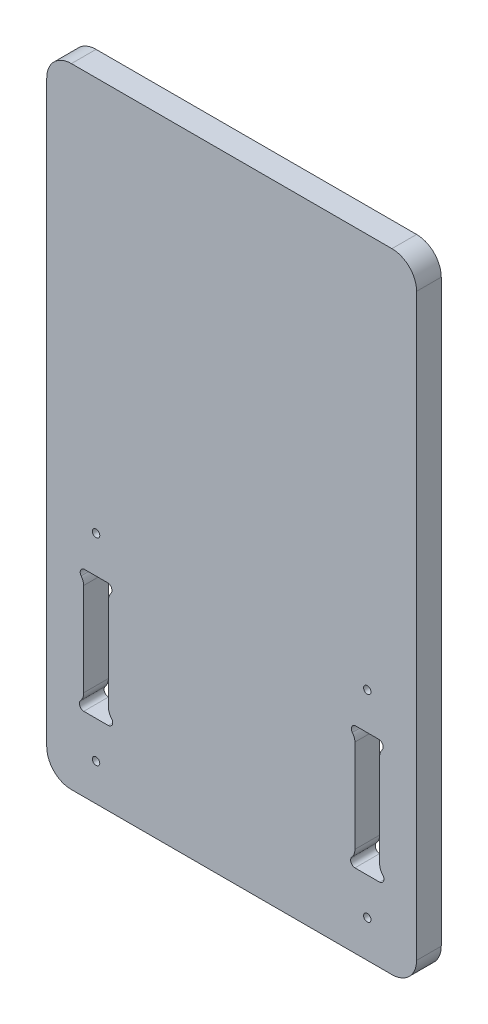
ISO-10303-21;
HEADER;
FILE_DESCRIPTION(('STEP AP214'),'2;1');
FILE_NAME('part.step','',(''),(''),'','','');
FILE_SCHEMA(('AUTOMOTIVE_DESIGN { 1 0 10303 214 1 1 1 1 }'));
ENDSEC;
DATA;
#1=APPLICATION_CONTEXT('core data for automotive mechanical design processes');
#2=APPLICATION_PROTOCOL_DEFINITION('international standard','automotive_design',2000,#1);
#3=PRODUCT_CONTEXT('',#1,'mechanical');
#4=PRODUCT('Part','Part','',(#3));
#5=PRODUCT_RELATED_PRODUCT_CATEGORY('part','',(#4));
#6=PRODUCT_DEFINITION_FORMATION('','',#4);
#7=PRODUCT_DEFINITION_CONTEXT('part definition',#1,'design');
#8=PRODUCT_DEFINITION('design','',#6,#7);
#9=PRODUCT_DEFINITION_SHAPE('','',#8);
#10=(LENGTH_UNIT() NAMED_UNIT(*) SI_UNIT(.MILLI.,.METRE.));
#11=(NAMED_UNIT(*) PLANE_ANGLE_UNIT() SI_UNIT($,.RADIAN.));
#12=(NAMED_UNIT(*) SI_UNIT($,.STERADIAN.) SOLID_ANGLE_UNIT());
#13=UNCERTAINTY_MEASURE_WITH_UNIT(LENGTH_MEASURE(1.E-05),#10,'distance_accuracy_value','');
#14=(GEOMETRIC_REPRESENTATION_CONTEXT(3) GLOBAL_UNCERTAINTY_ASSIGNED_CONTEXT((#13)) GLOBAL_UNIT_ASSIGNED_CONTEXT((#10,
#11,#12)) REPRESENTATION_CONTEXT('',''));
#15=CARTESIAN_POINT('',(0.,0.,0.));
#16=DIRECTION('',(0.,0.,1.));
#17=DIRECTION('',(1.,0.,0.));
#18=AXIS2_PLACEMENT_3D('',#15,#16,#17);
#19=CARTESIAN_POINT('',(-65.0000084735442,-45.0130180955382,10.));
#20=DIRECTION('',(0.,0.,1.));
#21=DIRECTION('',(1.,0.,0.));
#22=AXIS2_PLACEMENT_3D('',#19,#20,#21);
#23=PLANE('',#22);
#24=CARTESIAN_POINT('',(55.,-40.,10.));
#25=DIRECTION('',(0.,0.,1.));
#26=DIRECTION('',(-1.,0.,0.));
#27=AXIS2_PLACEMENT_3D('',#24,#25,#26);
#28=CIRCLE('',#27,1.5);
#29=CARTESIAN_POINT('',(53.5,-40.,10.));
#30=VERTEX_POINT('',#29);
#31=EDGE_CURVE('E588',#30,#30,#28,.T.);
#32=ORIENTED_EDGE('',*,*,#31,.F.);
#33=EDGE_LOOP('',(#32));
#34=FACE_BOUND('',#33,.T.);
#35=CARTESIAN_POINT('',(50.1277697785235,-23.1165738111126,10.));
#36=DIRECTION('',(0.,0.,1.));
#37=DIRECTION('',(1.,0.,0.));
#38=AXIS2_PLACEMENT_3D('',#35,#36,#37);
#39=CIRCLE('',#38,1.88775510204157);
#40=CARTESIAN_POINT('',(48.6220765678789,-21.9779310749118,10.));
#41=VERTEX_POINT('',#40);
#42=CARTESIAN_POINT('',(50.0000000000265,-25.,10.));
#43=VERTEX_POINT('',#42);
#44=EDGE_CURVE('E260',#41,#43,#39,.T.);
#45=ORIENTED_EDGE('',*,*,#44,.F.);
#46=CARTESIAN_POINT('',(44.8979591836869,-18.4905581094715,10.));
#47=DIRECTION('',(0.,0.,-1.));
#48=DIRECTION('',(1.,0.,0.));
#49=AXIS2_PLACEMENT_3D('',#46,#47,#48);
#50=CIRCLE('',#49,5.10204081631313);
#51=CARTESIAN_POINT('',(50.,-18.4905581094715,10.));
#52=VERTEX_POINT('',#51);
#53=EDGE_CURVE('E252',#52,#41,#50,.T.);
#54=ORIENTED_EDGE('',*,*,#53,.F.);
#55=DIRECTION('',(0.,-1.,0.));
#56=VECTOR('',#55,1.);
#57=CARTESIAN_POINT('',(50.,-18.4905581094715,10.));
#58=LINE('',#57,#56);
#59=CARTESIAN_POINT('',(50.,19.1989379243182,10.));
#60=VERTEX_POINT('',#59);
#61=EDGE_CURVE('E295',#60,#52,#58,.T.);
#62=ORIENTED_EDGE('',*,*,#61,.F.);
#63=CARTESIAN_POINT('',(44.9063812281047,18.9059049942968,10.));
#64=DIRECTION('',(0.,0.,-1.));
#65=DIRECTION('',(1.,0.,0.));
#66=AXIS2_PLACEMENT_3D('',#63,#64,#65);
#67=CIRCLE('',#66,5.10204081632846);
#68=CARTESIAN_POINT('',(48.9512370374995,22.0155612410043,10.));
#69=VERTEX_POINT('',#68);
#70=EDGE_CURVE('E293',#69,#60,#67,.T.);
#71=ORIENTED_EDGE('',*,*,#70,.F.);
#72=CARTESIAN_POINT('',(50.4478336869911,23.166134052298,10.));
#73=DIRECTION('',(0.,0.,1.));
#74=DIRECTION('',(1.,0.,0.));
#75=AXIS2_PLACEMENT_3D('',#72,#73,#74);
#76=CIRCLE('',#75,1.88775510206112);
#77=CARTESIAN_POINT('',(49.9999999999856,25.,10.));
#78=VERTEX_POINT('',#77);
#79=EDGE_CURVE('E291',#78,#69,#76,.T.);
#80=ORIENTED_EDGE('',*,*,#79,.F.);
#81=DIRECTION('',(-1.,0.,0.));
#82=VECTOR('',#81,1.);
#83=CARTESIAN_POINT('',(60.0000000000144,25.,10.));
#84=LINE('',#83,#82);
#85=CARTESIAN_POINT('',(60.0000000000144,25.,10.));
#86=VERTEX_POINT('',#85);
#87=EDGE_CURVE('E289',#86,#78,#84,.T.);
#88=ORIENTED_EDGE('',*,*,#87,.F.);
#89=CARTESIAN_POINT('',(59.5521663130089,23.166134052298,10.));
#90=DIRECTION('',(0.,0.,1.));
#91=DIRECTION('',(-1.,0.,0.));
#92=AXIS2_PLACEMENT_3D('',#89,#90,#91);
#93=CIRCLE('',#92,1.88775510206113);
#94=CARTESIAN_POINT('',(61.0487629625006,22.0155612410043,10.));
#95=VERTEX_POINT('',#94);
#96=EDGE_CURVE('E287',#95,#86,#93,.T.);
#97=ORIENTED_EDGE('',*,*,#96,.F.);
#98=CARTESIAN_POINT('',(65.0936187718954,18.9059049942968,10.));
#99=DIRECTION('',(0.,0.,-1.));
#100=DIRECTION('',(-1.,0.,0.));
#101=AXIS2_PLACEMENT_3D('',#98,#99,#100);
#102=CIRCLE('',#101,5.10204081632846);
#103=CARTESIAN_POINT('',(60.,19.1989379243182,10.));
#104=VERTEX_POINT('',#103);
#105=EDGE_CURVE('E285',#104,#95,#102,.T.);
#106=ORIENTED_EDGE('',*,*,#105,.F.);
#107=DIRECTION('',(0.,1.,0.));
#108=VECTOR('',#107,1.);
#109=CARTESIAN_POINT('',(60.,-18.4905581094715,10.));
#110=LINE('',#109,#108);
#111=CARTESIAN_POINT('',(60.,-18.4905581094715,10.));
#112=VERTEX_POINT('',#111);
#113=EDGE_CURVE('E283',#112,#104,#110,.T.);
#114=ORIENTED_EDGE('',*,*,#113,.F.);
#115=CARTESIAN_POINT('',(65.1020408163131,-18.4905581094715,10.));
#116=DIRECTION('',(0.,0.,-1.));
#117=DIRECTION('',(-1.,0.,0.));
#118=AXIS2_PLACEMENT_3D('',#115,#116,#117);
#119=CIRCLE('',#118,5.10204081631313);
#120=CARTESIAN_POINT('',(61.3779234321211,-21.9779310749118,10.));
#121=VERTEX_POINT('',#120);
#122=EDGE_CURVE('E281',#121,#112,#119,.T.);
#123=ORIENTED_EDGE('',*,*,#122,.F.);
#124=CARTESIAN_POINT('',(59.8722302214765,-23.1165738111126,10.));
#125=DIRECTION('',(0.,0.,1.));
#126=DIRECTION('',(-1.,0.,0.));
#127=AXIS2_PLACEMENT_3D('',#124,#125,#126);
#128=CIRCLE('',#127,1.88775510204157);
#129=CARTESIAN_POINT('',(59.9999999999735,-25.,10.));
#130=VERTEX_POINT('',#129);
#131=EDGE_CURVE('E276',#130,#121,#128,.T.);
#132=ORIENTED_EDGE('',*,*,#131,.F.);
#133=DIRECTION('',(1.,0.,0.));
#134=VECTOR('',#133,1.);
#135=CARTESIAN_POINT('',(50.0000000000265,-25.,10.));
#136=LINE('',#135,#134);
#137=EDGE_CURVE('E274',#43,#130,#136,.T.);
#138=ORIENTED_EDGE('',*,*,#137,.F.);
#139=EDGE_LOOP('',(#45,#54,#62,#71,#80,#88,#97,#106,#114,#123,#132,#138));
#140=FACE_BOUND('',#139,.T.);
#141=DIRECTION('',(1.,0.,0.));
#142=VECTOR('',#141,1.);
#143=CARTESIAN_POINT('',(-50.0000000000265,-25.,10.));
#144=LINE('',#143,#142);
#145=CARTESIAN_POINT('',(-59.9999999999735,-25.,10.));
#146=VERTEX_POINT('',#145);
#147=CARTESIAN_POINT('',(-50.0000000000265,-25.,10.));
#148=VERTEX_POINT('',#147);
#149=EDGE_CURVE('E350',#146,#148,#144,.T.);
#150=ORIENTED_EDGE('',*,*,#149,.F.);
#151=CARTESIAN_POINT('',(-59.8722302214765,-23.1165738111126,10.));
#152=DIRECTION('',(0.,0.,1.));
#153=DIRECTION('',(1.,0.,0.));
#154=AXIS2_PLACEMENT_3D('',#151,#152,#153);
#155=CIRCLE('',#154,1.88775510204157);
#156=CARTESIAN_POINT('',(-61.3779234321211,-21.9779310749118,10.));
#157=VERTEX_POINT('',#156);
#158=EDGE_CURVE('E348',#157,#146,#155,.T.);
#159=ORIENTED_EDGE('',*,*,#158,.F.);
#160=CARTESIAN_POINT('',(-65.1020408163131,-18.4905581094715,10.));
#161=DIRECTION('',(0.,0.,-1.));
#162=DIRECTION('',(1.,0.,0.));
#163=AXIS2_PLACEMENT_3D('',#160,#161,#162);
#164=CIRCLE('',#163,5.10204081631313);
#165=CARTESIAN_POINT('',(-60.,-18.4905581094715,10.));
#166=VERTEX_POINT('',#165);
#167=EDGE_CURVE('E372',#166,#157,#164,.T.);
#168=ORIENTED_EDGE('',*,*,#167,.F.);
#169=DIRECTION('',(0.,-1.,0.));
#170=VECTOR('',#169,1.);
#171=CARTESIAN_POINT('',(-60.,-18.4905581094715,10.));
#172=LINE('',#171,#170);
#173=CARTESIAN_POINT('',(-60.,19.1989379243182,10.));
#174=VERTEX_POINT('',#173);
#175=EDGE_CURVE('E369',#174,#166,#172,.T.);
#176=ORIENTED_EDGE('',*,*,#175,.F.);
#177=CARTESIAN_POINT('',(-65.0936187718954,18.9059049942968,10.));
#178=DIRECTION('',(0.,0.,-1.));
#179=DIRECTION('',(1.,0.,0.));
#180=AXIS2_PLACEMENT_3D('',#177,#178,#179);
#181=CIRCLE('',#180,5.10204081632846);
#182=CARTESIAN_POINT('',(-61.0487629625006,22.0155612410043,10.));
#183=VERTEX_POINT('',#182);
#184=EDGE_CURVE('E367',#183,#174,#181,.T.);
#185=ORIENTED_EDGE('',*,*,#184,.F.);
#186=CARTESIAN_POINT('',(-59.5521663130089,23.166134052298,10.));
#187=DIRECTION('',(0.,0.,1.));
#188=DIRECTION('',(1.,0.,0.));
#189=AXIS2_PLACEMENT_3D('',#186,#187,#188);
#190=CIRCLE('',#189,1.88775510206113);
#191=CARTESIAN_POINT('',(-60.0000000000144,25.,10.));
#192=VERTEX_POINT('',#191);
#193=EDGE_CURVE('E365',#192,#183,#190,.T.);
#194=ORIENTED_EDGE('',*,*,#193,.F.);
#195=DIRECTION('',(-1.,0.,0.));
#196=VECTOR('',#195,1.);
#197=CARTESIAN_POINT('',(-60.0000000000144,25.,10.));
#198=LINE('',#197,#196);
#199=CARTESIAN_POINT('',(-49.9999999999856,25.,10.));
#200=VERTEX_POINT('',#199);
#201=EDGE_CURVE('E363',#200,#192,#198,.T.);
#202=ORIENTED_EDGE('',*,*,#201,.F.);
#203=CARTESIAN_POINT('',(-50.4478336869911,23.166134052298,10.));
#204=DIRECTION('',(0.,0.,1.));
#205=DIRECTION('',(-1.,0.,0.));
#206=AXIS2_PLACEMENT_3D('',#203,#204,#205);
#207=CIRCLE('',#206,1.88775510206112);
#208=CARTESIAN_POINT('',(-48.9512370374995,22.0155612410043,10.));
#209=VERTEX_POINT('',#208);
#210=EDGE_CURVE('E361',#209,#200,#207,.T.);
#211=ORIENTED_EDGE('',*,*,#210,.F.);
#212=CARTESIAN_POINT('',(-44.9063812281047,18.9059049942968,10.));
#213=DIRECTION('',(0.,0.,-1.));
#214=DIRECTION('',(-1.,0.,0.));
#215=AXIS2_PLACEMENT_3D('',#212,#213,#214);
#216=CIRCLE('',#215,5.10204081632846);
#217=CARTESIAN_POINT('',(-50.,19.1989379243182,10.));
#218=VERTEX_POINT('',#217);
#219=EDGE_CURVE('E359',#218,#209,#216,.T.);
#220=ORIENTED_EDGE('',*,*,#219,.F.);
#221=DIRECTION('',(0.,1.,0.));
#222=VECTOR('',#221,1.);
#223=CARTESIAN_POINT('',(-50.,-18.4905581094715,10.));
#224=LINE('',#223,#222);
#225=CARTESIAN_POINT('',(-50.,-18.4905581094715,10.));
#226=VERTEX_POINT('',#225);
#227=EDGE_CURVE('E357',#226,#218,#224,.T.);
#228=ORIENTED_EDGE('',*,*,#227,.F.);
#229=CARTESIAN_POINT('',(-44.8979591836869,-18.4905581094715,10.));
#230=DIRECTION('',(0.,0.,-1.));
#231=DIRECTION('',(-1.,0.,0.));
#232=AXIS2_PLACEMENT_3D('',#229,#230,#231);
#233=CIRCLE('',#232,5.10204081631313);
#234=CARTESIAN_POINT('',(-48.6220765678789,-21.9779310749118,10.));
#235=VERTEX_POINT('',#234);
#236=EDGE_CURVE('E355',#235,#226,#233,.T.);
#237=ORIENTED_EDGE('',*,*,#236,.F.);
#238=CARTESIAN_POINT('',(-50.1277697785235,-23.1165738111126,10.));
#239=DIRECTION('',(0.,0.,1.));
#240=DIRECTION('',(-1.,0.,0.));
#241=AXIS2_PLACEMENT_3D('',#238,#239,#240);
#242=CIRCLE('',#241,1.88775510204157);
#243=EDGE_CURVE('E353',#148,#235,#242,.T.);
#244=ORIENTED_EDGE('',*,*,#243,.F.);
#245=EDGE_LOOP('',(#150,#159,#168,#176,#185,#194,#202,#211,#220,#228,#237,#244));
#246=FACE_BOUND('',#245,.T.);
#247=CARTESIAN_POINT('',(-55.,40.,10.));
#248=DIRECTION('',(0.,0.,1.));
#249=DIRECTION('',(-1.,0.,0.));
#250=AXIS2_PLACEMENT_3D('',#247,#248,#249);
#251=CIRCLE('',#250,1.5);
#252=CARTESIAN_POINT('',(-56.5,40.,10.));
#253=VERTEX_POINT('',#252);
#254=EDGE_CURVE('E435',#253,#253,#251,.T.);
#255=ORIENTED_EDGE('',*,*,#254,.F.);
#256=EDGE_LOOP('',(#255));
#257=FACE_BOUND('',#256,.T.);
#258=CARTESIAN_POINT('',(-65.0000084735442,-45.0130180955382,10.));
#259=DIRECTION('',(0.,0.,1.));
#260=DIRECTION('',(1.,0.,0.));
#261=AXIS2_PLACEMENT_3D('',#258,#259,#260);
#262=CIRCLE('',#261,10.);
#263=CARTESIAN_POINT('',(-75.,-45.,10.));
#264=VERTEX_POINT('',#263);
#265=CARTESIAN_POINT('',(-65.5100990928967,-55.,10.));
#266=VERTEX_POINT('',#265);
#267=EDGE_CURVE('E441',#264,#266,#262,.T.);
#268=ORIENTED_EDGE('',*,*,#267,.T.);
#269=DIRECTION('',(1.,0.,0.));
#270=VECTOR('',#269,1.);
#271=CARTESIAN_POINT('',(-65.5100990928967,-55.,10.));
#272=LINE('',#271,#270);
#273=CARTESIAN_POINT('',(65.1021458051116,-55.,10.));
#274=VERTEX_POINT('',#273);
#275=EDGE_CURVE('E444',#266,#274,#272,.T.);
#276=ORIENTED_EDGE('',*,*,#275,.T.);
#277=CARTESIAN_POINT('',(65.0000000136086,-45.0005217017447,10.));
#278=DIRECTION('',(0.,0.,1.));
#279=DIRECTION('',(1.,0.,0.));
#280=AXIS2_PLACEMENT_3D('',#277,#278,#279);
#281=CIRCLE('',#280,10.);
#282=CARTESIAN_POINT('',(75.,-45.0000000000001,10.));
#283=VERTEX_POINT('',#282);
#284=EDGE_CURVE('E447',#274,#283,#281,.T.);
#285=ORIENTED_EDGE('',*,*,#284,.T.);
#286=DIRECTION('',(0.,1.,0.));
#287=VECTOR('',#286,1.);
#288=CARTESIAN_POINT('',(75.,-45.0000000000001,10.));
#289=LINE('',#288,#287);
#290=CARTESIAN_POINT('',(75.,190.,10.));
#291=VERTEX_POINT('',#290);
#292=EDGE_CURVE('E449',#283,#291,#289,.T.);
#293=ORIENTED_EDGE('',*,*,#292,.T.);
#294=CARTESIAN_POINT('',(65.,190.,10.));
#295=DIRECTION('',(0.,0.,1.));
#296=DIRECTION('',(1.,0.,0.));
#297=AXIS2_PLACEMENT_3D('',#294,#295,#296);
#298=CIRCLE('',#297,10.);
#299=CARTESIAN_POINT('',(65.,200.,10.));
#300=VERTEX_POINT('',#299);
#301=EDGE_CURVE('E451',#291,#300,#298,.T.);
#302=ORIENTED_EDGE('',*,*,#301,.T.);
#303=DIRECTION('',(-1.,0.,0.));
#304=VECTOR('',#303,1.);
#305=CARTESIAN_POINT('',(-65.,200.,10.));
#306=LINE('',#305,#304);
#307=CARTESIAN_POINT('',(-65.,200.,10.));
#308=VERTEX_POINT('',#307);
#309=EDGE_CURVE('E453',#300,#308,#306,.T.);
#310=ORIENTED_EDGE('',*,*,#309,.T.);
#311=CARTESIAN_POINT('',(-65.,190.,10.));
#312=DIRECTION('',(0.,0.,1.));
#313=DIRECTION('',(-1.,0.,0.));
#314=AXIS2_PLACEMENT_3D('',#311,#312,#313);
#315=CIRCLE('',#314,10.);
#316=CARTESIAN_POINT('',(-75.,190.,10.));
#317=VERTEX_POINT('',#316);
#318=EDGE_CURVE('E455',#308,#317,#315,.T.);
#319=ORIENTED_EDGE('',*,*,#318,.T.);
#320=DIRECTION('',(0.,-1.,0.));
#321=VECTOR('',#320,1.);
#322=CARTESIAN_POINT('',(-75.,190.,10.));
#323=LINE('',#322,#321);
#324=EDGE_CURVE('E457',#317,#264,#323,.T.);
#325=ORIENTED_EDGE('',*,*,#324,.T.);
#326=EDGE_LOOP('',(#268,#276,#285,#293,#302,#310,#319,#325));
#327=FACE_BOUND('',#326,.T.);
#328=CARTESIAN_POINT('',(-55.,-40.,10.));
#329=DIRECTION('',(0.,0.,1.));
#330=DIRECTION('',(1.,0.,0.));
#331=AXIS2_PLACEMENT_3D('',#328,#329,#330);
#332=CIRCLE('',#331,1.5);
#333=CARTESIAN_POINT('',(-53.5,-40.,10.));
#334=VERTEX_POINT('',#333);
#335=EDGE_CURVE('E298',#334,#334,#332,.T.);
#336=ORIENTED_EDGE('',*,*,#335,.F.);
#337=EDGE_LOOP('',(#336));
#338=FACE_BOUND('',#337,.T.);
#339=CARTESIAN_POINT('',(55.,40.,10.));
#340=DIRECTION('',(0.,0.,1.));
#341=DIRECTION('',(1.,0.,0.));
#342=AXIS2_PLACEMENT_3D('',#339,#340,#341);
#343=CIRCLE('',#342,1.5);
#344=CARTESIAN_POINT('',(56.5,40.,10.));
#345=VERTEX_POINT('',#344);
#346=EDGE_CURVE('E583',#345,#345,#343,.T.);
#347=ORIENTED_EDGE('',*,*,#346,.F.);
#348=EDGE_LOOP('',(#347));
#349=FACE_BOUND('',#348,.T.);
#350=ADVANCED_FACE('F43',(#34,#140,#246,#257,#327,#338,#349),#23,.T.);
#351=CARTESIAN_POINT('',(-65.0000084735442,-45.0130180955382,0.));
#352=DIRECTION('',(0.,0.,1.));
#353=DIRECTION('',(1.,0.,0.));
#354=AXIS2_PLACEMENT_3D('',#351,#352,#353);
#355=PLANE('',#354);
#356=CARTESIAN_POINT('',(-59.8722302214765,-23.1165738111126,0.));
#357=DIRECTION('',(0.,0.,1.));
#358=DIRECTION('',(1.,0.,0.));
#359=AXIS2_PLACEMENT_3D('',#356,#357,#358);
#360=CIRCLE('',#359,1.88775510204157);
#361=CARTESIAN_POINT('',(-61.3779234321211,-21.9779310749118,0.));
#362=VERTEX_POINT('',#361);
#363=CARTESIAN_POINT('',(-59.9999999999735,-25.,0.));
#364=VERTEX_POINT('',#363);
#365=EDGE_CURVE('E268',#362,#364,#360,.T.);
#366=ORIENTED_EDGE('',*,*,#365,.T.);
#367=DIRECTION('',(1.,0.,0.));
#368=VECTOR('',#367,1.);
#369=CARTESIAN_POINT('',(-50.0000000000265,-25.,0.));
#370=LINE('',#369,#368);
#371=CARTESIAN_POINT('',(-50.0000000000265,-25.,0.));
#372=VERTEX_POINT('',#371);
#373=EDGE_CURVE('E377',#364,#372,#370,.T.);
#374=ORIENTED_EDGE('',*,*,#373,.T.);
#375=CARTESIAN_POINT('',(-50.1277697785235,-23.1165738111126,0.));
#376=DIRECTION('',(0.,0.,1.));
#377=DIRECTION('',(-1.,0.,0.));
#378=AXIS2_PLACEMENT_3D('',#375,#376,#377);
#379=CIRCLE('',#378,1.88775510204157);
#380=CARTESIAN_POINT('',(-48.6220765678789,-21.9779310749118,0.));
#381=VERTEX_POINT('',#380);
#382=EDGE_CURVE('E380',#372,#381,#379,.T.);
#383=ORIENTED_EDGE('',*,*,#382,.T.);
#384=CARTESIAN_POINT('',(-44.8979591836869,-18.4905581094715,0.));
#385=DIRECTION('',(0.,0.,-1.));
#386=DIRECTION('',(-1.,0.,0.));
#387=AXIS2_PLACEMENT_3D('',#384,#385,#386);
#388=CIRCLE('',#387,5.10204081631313);
#389=CARTESIAN_POINT('',(-50.,-18.4905581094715,0.));
#390=VERTEX_POINT('',#389);
#391=EDGE_CURVE('E383',#381,#390,#388,.T.);
#392=ORIENTED_EDGE('',*,*,#391,.T.);
#393=DIRECTION('',(0.,1.,0.));
#394=VECTOR('',#393,1.);
#395=CARTESIAN_POINT('',(-50.,-18.4905581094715,0.));
#396=LINE('',#395,#394);
#397=CARTESIAN_POINT('',(-50.,19.1989379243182,0.));
#398=VERTEX_POINT('',#397);
#399=EDGE_CURVE('E386',#390,#398,#396,.T.);
#400=ORIENTED_EDGE('',*,*,#399,.T.);
#401=CARTESIAN_POINT('',(-44.9063812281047,18.9059049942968,0.));
#402=DIRECTION('',(0.,0.,-1.));
#403=DIRECTION('',(-1.,0.,0.));
#404=AXIS2_PLACEMENT_3D('',#401,#402,#403);
#405=CIRCLE('',#404,5.10204081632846);
#406=CARTESIAN_POINT('',(-48.9512370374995,22.0155612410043,0.));
#407=VERTEX_POINT('',#406);
#408=EDGE_CURVE('E389',#398,#407,#405,.T.);
#409=ORIENTED_EDGE('',*,*,#408,.T.);
#410=CARTESIAN_POINT('',(-50.4478336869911,23.166134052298,0.));
#411=DIRECTION('',(0.,0.,1.));
#412=DIRECTION('',(-1.,0.,0.));
#413=AXIS2_PLACEMENT_3D('',#410,#411,#412);
#414=CIRCLE('',#413,1.88775510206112);
#415=CARTESIAN_POINT('',(-49.9999999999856,25.,0.));
#416=VERTEX_POINT('',#415);
#417=EDGE_CURVE('E392',#407,#416,#414,.T.);
#418=ORIENTED_EDGE('',*,*,#417,.T.);
#419=DIRECTION('',(-1.,0.,0.));
#420=VECTOR('',#419,1.);
#421=CARTESIAN_POINT('',(-60.0000000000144,25.,0.));
#422=LINE('',#421,#420);
#423=CARTESIAN_POINT('',(-60.0000000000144,25.,0.));
#424=VERTEX_POINT('',#423);
#425=EDGE_CURVE('E395',#416,#424,#422,.T.);
#426=ORIENTED_EDGE('',*,*,#425,.T.);
#427=CARTESIAN_POINT('',(-59.5521663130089,23.166134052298,0.));
#428=DIRECTION('',(0.,0.,1.));
#429=DIRECTION('',(1.,0.,0.));
#430=AXIS2_PLACEMENT_3D('',#427,#428,#429);
#431=CIRCLE('',#430,1.88775510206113);
#432=CARTESIAN_POINT('',(-61.0487629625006,22.0155612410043,0.));
#433=VERTEX_POINT('',#432);
#434=EDGE_CURVE('E398',#424,#433,#431,.T.);
#435=ORIENTED_EDGE('',*,*,#434,.T.);
#436=CARTESIAN_POINT('',(-65.0936187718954,18.9059049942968,0.));
#437=DIRECTION('',(0.,0.,-1.));
#438=DIRECTION('',(1.,0.,0.));
#439=AXIS2_PLACEMENT_3D('',#436,#437,#438);
#440=CIRCLE('',#439,5.10204081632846);
#441=CARTESIAN_POINT('',(-60.,19.1989379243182,0.));
#442=VERTEX_POINT('',#441);
#443=EDGE_CURVE('E401',#433,#442,#440,.T.);
#444=ORIENTED_EDGE('',*,*,#443,.T.);
#445=DIRECTION('',(0.,-1.,0.));
#446=VECTOR('',#445,1.);
#447=CARTESIAN_POINT('',(-60.,-18.4905581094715,0.));
#448=LINE('',#447,#446);
#449=CARTESIAN_POINT('',(-60.,-18.4905581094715,0.));
#450=VERTEX_POINT('',#449);
#451=EDGE_CURVE('E404',#442,#450,#448,.T.);
#452=ORIENTED_EDGE('',*,*,#451,.T.);
#453=CARTESIAN_POINT('',(-65.1020408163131,-18.4905581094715,0.));
#454=DIRECTION('',(0.,0.,-1.));
#455=DIRECTION('',(1.,0.,0.));
#456=AXIS2_PLACEMENT_3D('',#453,#454,#455);
#457=CIRCLE('',#456,5.10204081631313);
#458=EDGE_CURVE('E351',#450,#362,#457,.T.);
#459=ORIENTED_EDGE('',*,*,#458,.T.);
#460=EDGE_LOOP('',(#366,#374,#383,#392,#400,#409,#418,#426,#435,#444,#452,#459));
#461=FACE_BOUND('',#460,.T.);
#462=CARTESIAN_POINT('',(-65.0000084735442,-45.0130180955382,0.));
#463=DIRECTION('',(0.,0.,1.));
#464=DIRECTION('',(1.,0.,0.));
#465=AXIS2_PLACEMENT_3D('',#462,#463,#464);
#466=CIRCLE('',#465,10.);
#467=CARTESIAN_POINT('',(-75.,-45.,0.));
#468=VERTEX_POINT('',#467);
#469=CARTESIAN_POINT('',(-65.5100990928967,-55.,0.));
#470=VERTEX_POINT('',#469);
#471=EDGE_CURVE('E438',#468,#470,#466,.T.);
#472=ORIENTED_EDGE('',*,*,#471,.F.);
#473=DIRECTION('',(0.,-1.,0.));
#474=VECTOR('',#473,1.);
#475=CARTESIAN_POINT('',(-75.,190.,0.));
#476=LINE('',#475,#474);
#477=CARTESIAN_POINT('',(-75.,190.,0.));
#478=VERTEX_POINT('',#477);
#479=EDGE_CURVE('E445',#478,#468,#476,.T.);
#480=ORIENTED_EDGE('',*,*,#479,.F.);
#481=CARTESIAN_POINT('',(-65.,190.,0.));
#482=DIRECTION('',(0.,0.,1.));
#483=DIRECTION('',(-1.,0.,0.));
#484=AXIS2_PLACEMENT_3D('',#481,#482,#483);
#485=CIRCLE('',#484,10.);
#486=CARTESIAN_POINT('',(-65.,200.,0.));
#487=VERTEX_POINT('',#486);
#488=EDGE_CURVE('E472',#487,#478,#485,.T.);
#489=ORIENTED_EDGE('',*,*,#488,.F.);
#490=DIRECTION('',(-1.,0.,0.));
#491=VECTOR('',#490,1.);
#492=CARTESIAN_POINT('',(-65.,200.,0.));
#493=LINE('',#492,#491);
#494=CARTESIAN_POINT('',(65.,200.,0.));
#495=VERTEX_POINT('',#494);
#496=EDGE_CURVE('E470',#495,#487,#493,.T.);
#497=ORIENTED_EDGE('',*,*,#496,.F.);
#498=CARTESIAN_POINT('',(65.,190.,0.));
#499=DIRECTION('',(0.,0.,1.));
#500=DIRECTION('',(1.,0.,0.));
#501=AXIS2_PLACEMENT_3D('',#498,#499,#500);
#502=CIRCLE('',#501,10.);
#503=CARTESIAN_POINT('',(75.,190.,0.));
#504=VERTEX_POINT('',#503);
#505=EDGE_CURVE('E468',#504,#495,#502,.T.);
#506=ORIENTED_EDGE('',*,*,#505,.F.);
#507=DIRECTION('',(0.,1.,0.));
#508=VECTOR('',#507,1.);
#509=CARTESIAN_POINT('',(75.,-45.0000000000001,0.));
#510=LINE('',#509,#508);
#511=CARTESIAN_POINT('',(75.,-45.0000000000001,0.));
#512=VERTEX_POINT('',#511);
#513=EDGE_CURVE('E466',#512,#504,#510,.T.);
#514=ORIENTED_EDGE('',*,*,#513,.F.);
#515=CARTESIAN_POINT('',(65.0000000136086,-45.0005217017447,0.));
#516=DIRECTION('',(0.,0.,1.));
#517=DIRECTION('',(1.,0.,0.));
#518=AXIS2_PLACEMENT_3D('',#515,#516,#517);
#519=CIRCLE('',#518,10.);
#520=CARTESIAN_POINT('',(65.1021458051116,-55.,0.));
#521=VERTEX_POINT('',#520);
#522=EDGE_CURVE('E464',#521,#512,#519,.T.);
#523=ORIENTED_EDGE('',*,*,#522,.F.);
#524=DIRECTION('',(1.,0.,0.));
#525=VECTOR('',#524,1.);
#526=CARTESIAN_POINT('',(-65.5100990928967,-55.,0.));
#527=LINE('',#526,#525);
#528=EDGE_CURVE('E462',#470,#521,#527,.T.);
#529=ORIENTED_EDGE('',*,*,#528,.F.);
#530=EDGE_LOOP('',(#472,#480,#489,#497,#506,#514,#523,#529));
#531=FACE_BOUND('',#530,.T.);
#532=CARTESIAN_POINT('',(-55.,40.,0.));
#533=DIRECTION('',(0.,0.,1.));
#534=DIRECTION('',(-1.,0.,0.));
#535=AXIS2_PLACEMENT_3D('',#532,#533,#534);
#536=CIRCLE('',#535,1.5);
#537=CARTESIAN_POINT('',(-56.5,40.,0.));
#538=VERTEX_POINT('',#537);
#539=EDGE_CURVE('E434',#538,#538,#536,.T.);
#540=ORIENTED_EDGE('',*,*,#539,.T.);
#541=EDGE_LOOP('',(#540));
#542=FACE_BOUND('',#541,.T.);
#543=CARTESIAN_POINT('',(44.8979591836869,-18.4905581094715,0.));
#544=DIRECTION('',(0.,0.,-1.));
#545=DIRECTION('',(1.,0.,0.));
#546=AXIS2_PLACEMENT_3D('',#543,#544,#545);
#547=CIRCLE('',#546,5.10204081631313);
#548=CARTESIAN_POINT('',(50.,-18.4905581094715,0.));
#549=VERTEX_POINT('',#548);
#550=CARTESIAN_POINT('',(48.6220765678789,-21.9779310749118,0.));
#551=VERTEX_POINT('',#550);
#552=EDGE_CURVE('E66',#549,#551,#547,.T.);
#553=ORIENTED_EDGE('',*,*,#552,.T.);
#554=CARTESIAN_POINT('',(50.1277697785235,-23.1165738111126,0.));
#555=DIRECTION('',(0.,0.,1.));
#556=DIRECTION('',(1.,0.,0.));
#557=AXIS2_PLACEMENT_3D('',#554,#555,#556);
#558=CIRCLE('',#557,1.88775510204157);
#559=CARTESIAN_POINT('',(50.0000000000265,-25.,0.));
#560=VERTEX_POINT('',#559);
#561=EDGE_CURVE('E267',#551,#560,#558,.T.);
#562=ORIENTED_EDGE('',*,*,#561,.T.);
#563=DIRECTION('',(1.,0.,0.));
#564=VECTOR('',#563,1.);
#565=CARTESIAN_POINT('',(50.0000000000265,-25.,0.));
#566=LINE('',#565,#564);
#567=CARTESIAN_POINT('',(59.9999999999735,-25.,0.));
#568=VERTEX_POINT('',#567);
#569=EDGE_CURVE('E300',#560,#568,#566,.T.);
#570=ORIENTED_EDGE('',*,*,#569,.T.);
#571=CARTESIAN_POINT('',(59.8722302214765,-23.1165738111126,0.));
#572=DIRECTION('',(0.,0.,1.));
#573=DIRECTION('',(-1.,0.,0.));
#574=AXIS2_PLACEMENT_3D('',#571,#572,#573);
#575=CIRCLE('',#574,1.88775510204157);
#576=CARTESIAN_POINT('',(61.3779234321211,-21.9779310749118,0.));
#577=VERTEX_POINT('',#576);
#578=EDGE_CURVE('E303',#568,#577,#575,.T.);
#579=ORIENTED_EDGE('',*,*,#578,.T.);
#580=CARTESIAN_POINT('',(65.1020408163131,-18.4905581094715,0.));
#581=DIRECTION('',(0.,0.,-1.));
#582=DIRECTION('',(-1.,0.,0.));
#583=AXIS2_PLACEMENT_3D('',#580,#581,#582);
#584=CIRCLE('',#583,5.10204081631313);
#585=CARTESIAN_POINT('',(60.,-18.4905581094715,0.));
#586=VERTEX_POINT('',#585);
#587=EDGE_CURVE('E306',#577,#586,#584,.T.);
#588=ORIENTED_EDGE('',*,*,#587,.T.);
#589=DIRECTION('',(0.,1.,0.));
#590=VECTOR('',#589,1.);
#591=CARTESIAN_POINT('',(60.,-18.4905581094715,0.));
#592=LINE('',#591,#590);
#593=CARTESIAN_POINT('',(60.,19.1989379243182,0.));
#594=VERTEX_POINT('',#593);
#595=EDGE_CURVE('E309',#586,#594,#592,.T.);
#596=ORIENTED_EDGE('',*,*,#595,.T.);
#597=CARTESIAN_POINT('',(65.0936187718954,18.9059049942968,0.));
#598=DIRECTION('',(0.,0.,-1.));
#599=DIRECTION('',(-1.,0.,0.));
#600=AXIS2_PLACEMENT_3D('',#597,#598,#599);
#601=CIRCLE('',#600,5.10204081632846);
#602=CARTESIAN_POINT('',(61.0487629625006,22.0155612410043,0.));
#603=VERTEX_POINT('',#602);
#604=EDGE_CURVE('E312',#594,#603,#601,.T.);
#605=ORIENTED_EDGE('',*,*,#604,.T.);
#606=CARTESIAN_POINT('',(59.5521663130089,23.166134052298,0.));
#607=DIRECTION('',(0.,0.,1.));
#608=DIRECTION('',(-1.,0.,0.));
#609=AXIS2_PLACEMENT_3D('',#606,#607,#608);
#610=CIRCLE('',#609,1.88775510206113);
#611=CARTESIAN_POINT('',(60.0000000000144,25.,0.));
#612=VERTEX_POINT('',#611);
#613=EDGE_CURVE('E315',#603,#612,#610,.T.);
#614=ORIENTED_EDGE('',*,*,#613,.T.);
#615=DIRECTION('',(-1.,0.,0.));
#616=VECTOR('',#615,1.);
#617=CARTESIAN_POINT('',(60.0000000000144,25.,0.));
#618=LINE('',#617,#616);
#619=CARTESIAN_POINT('',(49.9999999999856,25.,0.));
#620=VERTEX_POINT('',#619);
#621=EDGE_CURVE('E318',#612,#620,#618,.T.);
#622=ORIENTED_EDGE('',*,*,#621,.T.);
#623=CARTESIAN_POINT('',(50.4478336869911,23.166134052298,0.));
#624=DIRECTION('',(0.,0.,1.));
#625=DIRECTION('',(1.,0.,0.));
#626=AXIS2_PLACEMENT_3D('',#623,#624,#625);
#627=CIRCLE('',#626,1.88775510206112);
#628=CARTESIAN_POINT('',(48.9512370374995,22.0155612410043,0.));
#629=VERTEX_POINT('',#628);
#630=EDGE_CURVE('E321',#620,#629,#627,.T.);
#631=ORIENTED_EDGE('',*,*,#630,.T.);
#632=CARTESIAN_POINT('',(44.9063812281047,18.9059049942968,0.));
#633=DIRECTION('',(0.,0.,-1.));
#634=DIRECTION('',(1.,0.,0.));
#635=AXIS2_PLACEMENT_3D('',#632,#633,#634);
#636=CIRCLE('',#635,5.10204081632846);
#637=CARTESIAN_POINT('',(50.,19.1989379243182,0.));
#638=VERTEX_POINT('',#637);
#639=EDGE_CURVE('E324',#629,#638,#636,.T.);
#640=ORIENTED_EDGE('',*,*,#639,.T.);
#641=DIRECTION('',(0.,-1.,0.));
#642=VECTOR('',#641,1.);
#643=CARTESIAN_POINT('',(50.,-18.4905581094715,0.));
#644=LINE('',#643,#642);
#645=EDGE_CURVE('E261',#638,#549,#644,.T.);
#646=ORIENTED_EDGE('',*,*,#645,.T.);
#647=EDGE_LOOP('',(#553,#562,#570,#579,#588,#596,#605,#614,#622,#631,#640,#646));
#648=FACE_BOUND('',#647,.T.);
#649=CARTESIAN_POINT('',(-55.,-40.,0.));
#650=DIRECTION('',(0.,0.,1.));
#651=DIRECTION('',(1.,0.,0.));
#652=AXIS2_PLACEMENT_3D('',#649,#650,#651);
#653=CIRCLE('',#652,1.5);
#654=CARTESIAN_POINT('',(-53.5,-40.,0.));
#655=VERTEX_POINT('',#654);
#656=EDGE_CURVE('E574',#655,#655,#653,.T.);
#657=ORIENTED_EDGE('',*,*,#656,.T.);
#658=EDGE_LOOP('',(#657));
#659=FACE_BOUND('',#658,.T.);
#660=CARTESIAN_POINT('',(55.,-40.,0.));
#661=DIRECTION('',(0.,0.,1.));
#662=DIRECTION('',(-1.,0.,0.));
#663=AXIS2_PLACEMENT_3D('',#660,#661,#662);
#664=CIRCLE('',#663,1.5);
#665=CARTESIAN_POINT('',(53.5,-40.,0.));
#666=VERTEX_POINT('',#665);
#667=EDGE_CURVE('E578',#666,#666,#664,.T.);
#668=ORIENTED_EDGE('',*,*,#667,.T.);
#669=EDGE_LOOP('',(#668));
#670=FACE_BOUND('',#669,.T.);
#671=CARTESIAN_POINT('',(55.,40.,0.));
#672=DIRECTION('',(0.,0.,1.));
#673=DIRECTION('',(1.,0.,0.));
#674=AXIS2_PLACEMENT_3D('',#671,#672,#673);
#675=CIRCLE('',#674,1.5);
#676=CARTESIAN_POINT('',(56.5,40.,0.));
#677=VERTEX_POINT('',#676);
#678=EDGE_CURVE('E581',#677,#677,#675,.T.);
#679=ORIENTED_EDGE('',*,*,#678,.T.);
#680=EDGE_LOOP('',(#679));
#681=FACE_BOUND('',#680,.T.);
#682=ADVANCED_FACE('F502',(#461,#531,#542,#648,#659,#670,#681),#355,.F.);
#683=CARTESIAN_POINT('',(-65.0000084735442,-45.0130180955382,10.));
#684=DIRECTION('',(0.,0.,-1.));
#685=DIRECTION('',(-1.,0.,0.));
#686=AXIS2_PLACEMENT_3D('',#683,#684,#685);
#687=CYLINDRICAL_SURFACE('',#686,10.);
#688=ORIENTED_EDGE('',*,*,#471,.T.);
#689=DIRECTION('',(0.,0.,-1.));
#690=VECTOR('',#689,1.);
#691=CARTESIAN_POINT('',(-65.5100990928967,-55.,10.));
#692=LINE('',#691,#690);
#693=EDGE_CURVE('E11',#266,#470,#692,.T.);
#694=ORIENTED_EDGE('',*,*,#693,.F.);
#695=ORIENTED_EDGE('',*,*,#267,.F.);
#696=DIRECTION('',(0.,0.,-1.));
#697=VECTOR('',#696,1.);
#698=CARTESIAN_POINT('',(-75.,-45.,10.));
#699=LINE('',#698,#697);
#700=EDGE_CURVE('E459',#264,#468,#699,.T.);
#701=ORIENTED_EDGE('',*,*,#700,.T.);
#702=EDGE_LOOP('',(#688,#694,#695,#701));
#703=FACE_BOUND('',#702,.T.);
#704=ADVANCED_FACE('F45',(#703),#687,.T.);
#705=CARTESIAN_POINT('',(-65.5100990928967,-55.,10.));
#706=DIRECTION('',(0.,1.,0.));
#707=DIRECTION('',(0.,0.,1.));
#708=AXIS2_PLACEMENT_3D('',#705,#706,#707);
#709=PLANE('',#708);
#710=ORIENTED_EDGE('',*,*,#528,.T.);
#711=DIRECTION('',(0.,0.,-1.));
#712=VECTOR('',#711,1.);
#713=CARTESIAN_POINT('',(65.1021458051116,-55.,10.));
#714=LINE('',#713,#712);
#715=EDGE_CURVE('E51',#274,#521,#714,.T.);
#716=ORIENTED_EDGE('',*,*,#715,.F.);
#717=ORIENTED_EDGE('',*,*,#275,.F.);
#718=ORIENTED_EDGE('',*,*,#693,.T.);
#719=EDGE_LOOP('',(#710,#716,#717,#718));
#720=FACE_BOUND('',#719,.T.);
#721=ADVANCED_FACE('F520',(#720),#709,.F.);
#722=CARTESIAN_POINT('',(65.0000000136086,-45.0005217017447,10.));
#723=DIRECTION('',(0.,0.,-1.));
#724=DIRECTION('',(-1.,0.,0.));
#725=AXIS2_PLACEMENT_3D('',#722,#723,#724);
#726=CYLINDRICAL_SURFACE('',#725,10.);
#727=ORIENTED_EDGE('',*,*,#522,.T.);
#728=DIRECTION('',(0.,0.,-1.));
#729=VECTOR('',#728,1.);
#730=CARTESIAN_POINT('',(75.,-45.0000000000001,10.));
#731=LINE('',#730,#729);
#732=EDGE_CURVE('E489',#283,#512,#731,.T.);
#733=ORIENTED_EDGE('',*,*,#732,.F.);
#734=ORIENTED_EDGE('',*,*,#284,.F.);
#735=ORIENTED_EDGE('',*,*,#715,.T.);
#736=EDGE_LOOP('',(#727,#733,#734,#735));
#737=FACE_BOUND('',#736,.T.);
#738=ADVANCED_FACE('F496',(#737),#726,.T.);
#739=CARTESIAN_POINT('',(75.,-45.0000000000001,10.));
#740=DIRECTION('',(-1.,0.,0.));
#741=DIRECTION('',(0.,0.,1.));
#742=AXIS2_PLACEMENT_3D('',#739,#740,#741);
#743=PLANE('',#742);
#744=ORIENTED_EDGE('',*,*,#513,.T.);
#745=DIRECTION('',(0.,0.,-1.));
#746=VECTOR('',#745,1.);
#747=CARTESIAN_POINT('',(75.,190.,10.));
#748=LINE('',#747,#746);
#749=EDGE_CURVE('E486',#291,#504,#748,.T.);
#750=ORIENTED_EDGE('',*,*,#749,.F.);
#751=ORIENTED_EDGE('',*,*,#292,.F.);
#752=ORIENTED_EDGE('',*,*,#732,.T.);
#753=EDGE_LOOP('',(#744,#750,#751,#752));
#754=FACE_BOUND('',#753,.T.);
#755=ADVANCED_FACE('F508',(#754),#743,.F.);
#756=CARTESIAN_POINT('',(65.,190.,10.));
#757=DIRECTION('',(0.,0.,-1.));
#758=DIRECTION('',(-1.,0.,0.));
#759=AXIS2_PLACEMENT_3D('',#756,#757,#758);
#760=CYLINDRICAL_SURFACE('',#759,10.);
#761=ORIENTED_EDGE('',*,*,#505,.T.);
#762=DIRECTION('',(0.,0.,-1.));
#763=VECTOR('',#762,1.);
#764=CARTESIAN_POINT('',(65.,200.,10.));
#765=LINE('',#764,#763);
#766=EDGE_CURVE('E483',#300,#495,#765,.T.);
#767=ORIENTED_EDGE('',*,*,#766,.F.);
#768=ORIENTED_EDGE('',*,*,#301,.F.);
#769=ORIENTED_EDGE('',*,*,#749,.T.);
#770=EDGE_LOOP('',(#761,#767,#768,#769));
#771=FACE_BOUND('',#770,.T.);
#772=ADVANCED_FACE('F512',(#771),#760,.T.);
#773=CARTESIAN_POINT('',(-65.,200.,10.));
#774=DIRECTION('',(0.,-1.,0.));
#775=DIRECTION('',(0.,0.,-1.));
#776=AXIS2_PLACEMENT_3D('',#773,#774,#775);
#777=PLANE('',#776);
#778=ORIENTED_EDGE('',*,*,#496,.T.);
#779=DIRECTION('',(0.,0.,-1.));
#780=VECTOR('',#779,1.);
#781=CARTESIAN_POINT('',(-65.,200.,10.));
#782=LINE('',#781,#780);
#783=EDGE_CURVE('E480',#308,#487,#782,.T.);
#784=ORIENTED_EDGE('',*,*,#783,.F.);
#785=ORIENTED_EDGE('',*,*,#309,.F.);
#786=ORIENTED_EDGE('',*,*,#766,.T.);
#787=EDGE_LOOP('',(#778,#784,#785,#786));
#788=FACE_BOUND('',#787,.T.);
#789=ADVANCED_FACE('F533',(#788),#777,.F.);
#790=CARTESIAN_POINT('',(-65.,190.,10.));
#791=DIRECTION('',(0.,0.,-1.));
#792=DIRECTION('',(-1.,0.,0.));
#793=AXIS2_PLACEMENT_3D('',#790,#791,#792);
#794=CYLINDRICAL_SURFACE('',#793,10.);
#795=ORIENTED_EDGE('',*,*,#488,.T.);
#796=DIRECTION('',(0.,0.,-1.));
#797=VECTOR('',#796,1.);
#798=CARTESIAN_POINT('',(-75.,190.,10.));
#799=LINE('',#798,#797);
#800=EDGE_CURVE('E477',#317,#478,#799,.T.);
#801=ORIENTED_EDGE('',*,*,#800,.F.);
#802=ORIENTED_EDGE('',*,*,#318,.F.);
#803=ORIENTED_EDGE('',*,*,#783,.T.);
#804=EDGE_LOOP('',(#795,#801,#802,#803));
#805=FACE_BOUND('',#804,.T.);
#806=ADVANCED_FACE('F531',(#805),#794,.T.);
#807=CARTESIAN_POINT('',(-75.,190.,10.));
#808=DIRECTION('',(1.,0.,0.));
#809=DIRECTION('',(0.,0.,-1.));
#810=AXIS2_PLACEMENT_3D('',#807,#808,#809);
#811=PLANE('',#810);
#812=ORIENTED_EDGE('',*,*,#479,.T.);
#813=ORIENTED_EDGE('',*,*,#700,.F.);
#814=ORIENTED_EDGE('',*,*,#324,.F.);
#815=ORIENTED_EDGE('',*,*,#800,.T.);
#816=EDGE_LOOP('',(#812,#813,#814,#815));
#817=FACE_BOUND('',#816,.T.);
#818=ADVANCED_FACE('F526',(#817),#811,.F.);
#819=CARTESIAN_POINT('',(-55.,40.,10.));
#820=DIRECTION('',(0.,0.,-1.));
#821=DIRECTION('',(-1.,0.,0.));
#822=AXIS2_PLACEMENT_3D('',#819,#820,#821);
#823=CYLINDRICAL_SURFACE('',#822,1.5);
#824=ORIENTED_EDGE('',*,*,#254,.T.);
#825=EDGE_LOOP('',(#824));
#826=FACE_BOUND('',#825,.T.);
#827=ORIENTED_EDGE('',*,*,#539,.F.);
#828=EDGE_LOOP('',(#827));
#829=FACE_BOUND('',#828,.T.);
#830=ADVANCED_FACE('F552',(#826,#829),#823,.F.);
#831=CARTESIAN_POINT('',(-59.8722302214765,-23.1165738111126,10.));
#832=DIRECTION('',(0.,0.,-1.));
#833=DIRECTION('',(-1.,0.,0.));
#834=AXIS2_PLACEMENT_3D('',#831,#832,#833);
#835=CYLINDRICAL_SURFACE('',#834,1.88775510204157);
#836=ORIENTED_EDGE('',*,*,#365,.F.);
#837=DIRECTION('',(0.,0.,-1.));
#838=VECTOR('',#837,1.);
#839=CARTESIAN_POINT('',(-61.3779234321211,-21.9779310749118,10.));
#840=LINE('',#839,#838);
#841=EDGE_CURVE('E374',#157,#362,#840,.T.);
#842=ORIENTED_EDGE('',*,*,#841,.F.);
#843=ORIENTED_EDGE('',*,*,#158,.T.);
#844=DIRECTION('',(0.,0.,-1.));
#845=VECTOR('',#844,1.);
#846=CARTESIAN_POINT('',(-59.9999999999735,-25.,10.));
#847=LINE('',#846,#845);
#848=EDGE_CURVE('E431',#146,#364,#847,.T.);
#849=ORIENTED_EDGE('',*,*,#848,.T.);
#850=EDGE_LOOP('',(#836,#842,#843,#849));
#851=FACE_BOUND('',#850,.T.);
#852=ADVANCED_FACE('F559',(#851),#835,.F.);
#853=CARTESIAN_POINT('',(-50.0000000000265,-25.,10.));
#854=DIRECTION('',(0.,1.,0.));
#855=DIRECTION('',(0.,0.,1.));
#856=AXIS2_PLACEMENT_3D('',#853,#854,#855);
#857=PLANE('',#856);
#858=ORIENTED_EDGE('',*,*,#373,.F.);
#859=ORIENTED_EDGE('',*,*,#848,.F.);
#860=ORIENTED_EDGE('',*,*,#149,.T.);
#861=DIRECTION('',(0.,0.,-1.));
#862=VECTOR('',#861,1.);
#863=CARTESIAN_POINT('',(-50.0000000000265,-25.,10.));
#864=LINE('',#863,#862);
#865=EDGE_CURVE('E429',#148,#372,#864,.T.);
#866=ORIENTED_EDGE('',*,*,#865,.T.);
#867=EDGE_LOOP('',(#858,#859,#860,#866));
#868=FACE_BOUND('',#867,.T.);
#869=ADVANCED_FACE('F564',(#868),#857,.T.);
#870=CARTESIAN_POINT('',(-50.1277697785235,-23.1165738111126,10.));
#871=DIRECTION('',(0.,0.,-1.));
#872=DIRECTION('',(-1.,0.,0.));
#873=AXIS2_PLACEMENT_3D('',#870,#871,#872);
#874=CYLINDRICAL_SURFACE('',#873,1.88775510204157);
#875=ORIENTED_EDGE('',*,*,#382,.F.);
#876=ORIENTED_EDGE('',*,*,#865,.F.);
#877=ORIENTED_EDGE('',*,*,#243,.T.);
#878=DIRECTION('',(0.,0.,-1.));
#879=VECTOR('',#878,1.);
#880=CARTESIAN_POINT('',(-48.6220765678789,-21.9779310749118,10.));
#881=LINE('',#880,#879);
#882=EDGE_CURVE('E427',#235,#381,#881,.T.);
#883=ORIENTED_EDGE('',*,*,#882,.T.);
#884=EDGE_LOOP('',(#875,#876,#877,#883));
#885=FACE_BOUND('',#884,.T.);
#886=ADVANCED_FACE('F690',(#885),#874,.F.);
#887=CARTESIAN_POINT('',(-44.8979591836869,-18.4905581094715,10.));
#888=DIRECTION('',(0.,0.,-1.));
#889=DIRECTION('',(-1.,0.,0.));
#890=AXIS2_PLACEMENT_3D('',#887,#888,#889);
#891=CYLINDRICAL_SURFACE('',#890,5.10204081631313);
#892=ORIENTED_EDGE('',*,*,#391,.F.);
#893=ORIENTED_EDGE('',*,*,#882,.F.);
#894=ORIENTED_EDGE('',*,*,#236,.T.);
#895=DIRECTION('',(0.,0.,-1.));
#896=VECTOR('',#895,1.);
#897=CARTESIAN_POINT('',(-50.,-18.4905581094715,10.));
#898=LINE('',#897,#896);
#899=EDGE_CURVE('E425',#226,#390,#898,.T.);
#900=ORIENTED_EDGE('',*,*,#899,.T.);
#901=EDGE_LOOP('',(#892,#893,#894,#900));
#902=FACE_BOUND('',#901,.T.);
#903=ADVANCED_FACE('F686',(#902),#891,.T.);
#904=CARTESIAN_POINT('',(-50.,-18.4905581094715,10.));
#905=DIRECTION('',(-1.,0.,0.));
#906=DIRECTION('',(0.,-1.,0.));
#907=AXIS2_PLACEMENT_3D('',#904,#905,#906);
#908=PLANE('',#907);
#909=ORIENTED_EDGE('',*,*,#399,.F.);
#910=ORIENTED_EDGE('',*,*,#899,.F.);
#911=ORIENTED_EDGE('',*,*,#227,.T.);
#912=DIRECTION('',(0.,0.,-1.));
#913=VECTOR('',#912,1.);
#914=CARTESIAN_POINT('',(-50.,19.1989379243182,10.));
#915=LINE('',#914,#913);
#916=EDGE_CURVE('E423',#218,#398,#915,.T.);
#917=ORIENTED_EDGE('',*,*,#916,.T.);
#918=EDGE_LOOP('',(#909,#910,#911,#917));
#919=FACE_BOUND('',#918,.T.);
#920=ADVANCED_FACE('F682',(#919),#908,.T.);
#921=CARTESIAN_POINT('',(-44.9063812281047,18.9059049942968,10.));
#922=DIRECTION('',(0.,0.,-1.));
#923=DIRECTION('',(-1.,0.,0.));
#924=AXIS2_PLACEMENT_3D('',#921,#922,#923);
#925=CYLINDRICAL_SURFACE('',#924,5.10204081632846);
#926=ORIENTED_EDGE('',*,*,#408,.F.);
#927=ORIENTED_EDGE('',*,*,#916,.F.);
#928=ORIENTED_EDGE('',*,*,#219,.T.);
#929=DIRECTION('',(0.,0.,-1.));
#930=VECTOR('',#929,1.);
#931=CARTESIAN_POINT('',(-48.9512370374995,22.0155612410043,10.));
#932=LINE('',#931,#930);
#933=EDGE_CURVE('E421',#209,#407,#932,.T.);
#934=ORIENTED_EDGE('',*,*,#933,.T.);
#935=EDGE_LOOP('',(#926,#927,#928,#934));
#936=FACE_BOUND('',#935,.T.);
#937=ADVANCED_FACE('F678',(#936),#925,.T.);
#938=CARTESIAN_POINT('',(-50.4478336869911,23.166134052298,10.));
#939=DIRECTION('',(0.,0.,-1.));
#940=DIRECTION('',(-1.,0.,0.));
#941=AXIS2_PLACEMENT_3D('',#938,#939,#940);
#942=CYLINDRICAL_SURFACE('',#941,1.88775510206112);
#943=ORIENTED_EDGE('',*,*,#417,.F.);
#944=ORIENTED_EDGE('',*,*,#933,.F.);
#945=ORIENTED_EDGE('',*,*,#210,.T.);
#946=DIRECTION('',(0.,0.,-1.));
#947=VECTOR('',#946,1.);
#948=CARTESIAN_POINT('',(-49.9999999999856,25.,10.));
#949=LINE('',#948,#947);
#950=EDGE_CURVE('E419',#200,#416,#949,.T.);
#951=ORIENTED_EDGE('',*,*,#950,.T.);
#952=EDGE_LOOP('',(#943,#944,#945,#951));
#953=FACE_BOUND('',#952,.T.);
#954=ADVANCED_FACE('F674',(#953),#942,.F.);
#955=CARTESIAN_POINT('',(-60.0000000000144,25.,10.));
#956=DIRECTION('',(0.,-1.,0.));
#957=DIRECTION('',(0.,0.,-1.));
#958=AXIS2_PLACEMENT_3D('',#955,#956,#957);
#959=PLANE('',#958);
#960=ORIENTED_EDGE('',*,*,#425,.F.);
#961=ORIENTED_EDGE('',*,*,#950,.F.);
#962=ORIENTED_EDGE('',*,*,#201,.T.);
#963=DIRECTION('',(0.,0.,-1.));
#964=VECTOR('',#963,1.);
#965=CARTESIAN_POINT('',(-60.0000000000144,25.,10.));
#966=LINE('',#965,#964);
#967=EDGE_CURVE('E417',#192,#424,#966,.T.);
#968=ORIENTED_EDGE('',*,*,#967,.T.);
#969=EDGE_LOOP('',(#960,#961,#962,#968));
#970=FACE_BOUND('',#969,.T.);
#971=ADVANCED_FACE('F670',(#970),#959,.T.);
#972=CARTESIAN_POINT('',(-59.5521663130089,23.166134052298,10.));
#973=DIRECTION('',(0.,0.,-1.));
#974=DIRECTION('',(-1.,0.,0.));
#975=AXIS2_PLACEMENT_3D('',#972,#973,#974);
#976=CYLINDRICAL_SURFACE('',#975,1.88775510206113);
#977=ORIENTED_EDGE('',*,*,#434,.F.);
#978=ORIENTED_EDGE('',*,*,#967,.F.);
#979=ORIENTED_EDGE('',*,*,#193,.T.);
#980=DIRECTION('',(0.,0.,-1.));
#981=VECTOR('',#980,1.);
#982=CARTESIAN_POINT('',(-61.0487629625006,22.0155612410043,10.));
#983=LINE('',#982,#981);
#984=EDGE_CURVE('E415',#183,#433,#983,.T.);
#985=ORIENTED_EDGE('',*,*,#984,.T.);
#986=EDGE_LOOP('',(#977,#978,#979,#985));
#987=FACE_BOUND('',#986,.T.);
#988=ADVANCED_FACE('F666',(#987),#976,.F.);
#989=CARTESIAN_POINT('',(-65.0936187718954,18.9059049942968,10.));
#990=DIRECTION('',(0.,0.,-1.));
#991=DIRECTION('',(-1.,0.,0.));
#992=AXIS2_PLACEMENT_3D('',#989,#990,#991);
#993=CYLINDRICAL_SURFACE('',#992,5.10204081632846);
#994=ORIENTED_EDGE('',*,*,#443,.F.);
#995=ORIENTED_EDGE('',*,*,#984,.F.);
#996=ORIENTED_EDGE('',*,*,#184,.T.);
#997=DIRECTION('',(0.,0.,-1.));
#998=VECTOR('',#997,1.);
#999=CARTESIAN_POINT('',(-60.,19.1989379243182,10.));
#1000=LINE('',#999,#998);
#1001=EDGE_CURVE('E413',#174,#442,#1000,.T.);
#1002=ORIENTED_EDGE('',*,*,#1001,.T.);
#1003=EDGE_LOOP('',(#994,#995,#996,#1002));
#1004=FACE_BOUND('',#1003,.T.);
#1005=ADVANCED_FACE('F662',(#1004),#993,.T.);
#1006=CARTESIAN_POINT('',(-60.,-18.4905581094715,10.));
#1007=DIRECTION('',(1.,0.,0.));
#1008=DIRECTION('',(0.,1.,0.));
#1009=AXIS2_PLACEMENT_3D('',#1006,#1007,#1008);
#1010=PLANE('',#1009);
#1011=ORIENTED_EDGE('',*,*,#451,.F.);
#1012=ORIENTED_EDGE('',*,*,#1001,.F.);
#1013=ORIENTED_EDGE('',*,*,#175,.T.);
#1014=DIRECTION('',(0.,0.,-1.));
#1015=VECTOR('',#1014,1.);
#1016=CARTESIAN_POINT('',(-60.,-18.4905581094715,10.));
#1017=LINE('',#1016,#1015);
#1018=EDGE_CURVE('E411',#166,#450,#1017,.T.);
#1019=ORIENTED_EDGE('',*,*,#1018,.T.);
#1020=EDGE_LOOP('',(#1011,#1012,#1013,#1019));
#1021=FACE_BOUND('',#1020,.T.);
#1022=ADVANCED_FACE('F658',(#1021),#1010,.T.);
#1023=CARTESIAN_POINT('',(-65.1020408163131,-18.4905581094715,10.));
#1024=DIRECTION('',(0.,0.,-1.));
#1025=DIRECTION('',(-1.,0.,0.));
#1026=AXIS2_PLACEMENT_3D('',#1023,#1024,#1025);
#1027=CYLINDRICAL_SURFACE('',#1026,5.10204081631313);
#1028=ORIENTED_EDGE('',*,*,#458,.F.);
#1029=ORIENTED_EDGE('',*,*,#1018,.F.);
#1030=ORIENTED_EDGE('',*,*,#167,.T.);
#1031=ORIENTED_EDGE('',*,*,#841,.T.);
#1032=EDGE_LOOP('',(#1028,#1029,#1030,#1031));
#1033=FACE_BOUND('',#1032,.T.);
#1034=ADVANCED_FACE('F655',(#1033),#1027,.T.);
#1035=CARTESIAN_POINT('',(44.8979591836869,-18.4905581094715,10.));
#1036=DIRECTION('',(0.,0.,-1.));
#1037=DIRECTION('',(-1.,0.,0.));
#1038=AXIS2_PLACEMENT_3D('',#1035,#1036,#1037);
#1039=CYLINDRICAL_SURFACE('',#1038,5.10204081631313);
#1040=ORIENTED_EDGE('',*,*,#552,.F.);
#1041=DIRECTION('',(0.,0.,-1.));
#1042=VECTOR('',#1041,1.);
#1043=CARTESIAN_POINT('',(50.,-18.4905581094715,10.));
#1044=LINE('',#1043,#1042);
#1045=EDGE_CURVE('E256',#52,#549,#1044,.T.);
#1046=ORIENTED_EDGE('',*,*,#1045,.F.);
#1047=ORIENTED_EDGE('',*,*,#53,.T.);
#1048=DIRECTION('',(0.,0.,-1.));
#1049=VECTOR('',#1048,1.);
#1050=CARTESIAN_POINT('',(48.6220765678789,-21.9779310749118,10.));
#1051=LINE('',#1050,#1049);
#1052=EDGE_CURVE('E255',#41,#551,#1051,.T.);
#1053=ORIENTED_EDGE('',*,*,#1052,.T.);
#1054=EDGE_LOOP('',(#1040,#1046,#1047,#1053));
#1055=FACE_BOUND('',#1054,.T.);
#1056=ADVANCED_FACE('F254',(#1055),#1039,.T.);
#1057=CARTESIAN_POINT('',(50.1277697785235,-23.1165738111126,10.));
#1058=DIRECTION('',(0.,0.,-1.));
#1059=DIRECTION('',(-1.,0.,0.));
#1060=AXIS2_PLACEMENT_3D('',#1057,#1058,#1059);
#1061=CYLINDRICAL_SURFACE('',#1060,1.88775510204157);
#1062=ORIENTED_EDGE('',*,*,#561,.F.);
#1063=ORIENTED_EDGE('',*,*,#1052,.F.);
#1064=ORIENTED_EDGE('',*,*,#44,.T.);
#1065=DIRECTION('',(0.,0.,-1.));
#1066=VECTOR('',#1065,1.);
#1067=CARTESIAN_POINT('',(50.0000000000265,-25.,10.));
#1068=LINE('',#1067,#1066);
#1069=EDGE_CURVE('E269',#43,#560,#1068,.T.);
#1070=ORIENTED_EDGE('',*,*,#1069,.T.);
#1071=EDGE_LOOP('',(#1062,#1063,#1064,#1070));
#1072=FACE_BOUND('',#1071,.T.);
#1073=ADVANCED_FACE('F264',(#1072),#1061,.F.);
#1074=CARTESIAN_POINT('',(50.0000000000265,-25.,10.));
#1075=DIRECTION('',(0.,1.,0.));
#1076=DIRECTION('',(0.,0.,1.));
#1077=AXIS2_PLACEMENT_3D('',#1074,#1075,#1076);
#1078=PLANE('',#1077);
#1079=ORIENTED_EDGE('',*,*,#569,.F.);
#1080=ORIENTED_EDGE('',*,*,#1069,.F.);
#1081=ORIENTED_EDGE('',*,*,#137,.T.);
#1082=DIRECTION('',(0.,0.,-1.));
#1083=VECTOR('',#1082,1.);
#1084=CARTESIAN_POINT('',(59.9999999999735,-25.,10.));
#1085=LINE('',#1084,#1083);
#1086=EDGE_CURVE('E345',#130,#568,#1085,.T.);
#1087=ORIENTED_EDGE('',*,*,#1086,.T.);
#1088=EDGE_LOOP('',(#1079,#1080,#1081,#1087));
#1089=FACE_BOUND('',#1088,.T.);
#1090=ADVANCED_FACE('F646',(#1089),#1078,.T.);
#1091=CARTESIAN_POINT('',(59.8722302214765,-23.1165738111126,10.));
#1092=DIRECTION('',(0.,0.,-1.));
#1093=DIRECTION('',(-1.,0.,0.));
#1094=AXIS2_PLACEMENT_3D('',#1091,#1092,#1093);
#1095=CYLINDRICAL_SURFACE('',#1094,1.88775510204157);
#1096=ORIENTED_EDGE('',*,*,#578,.F.);
#1097=ORIENTED_EDGE('',*,*,#1086,.F.);
#1098=ORIENTED_EDGE('',*,*,#131,.T.);
#1099=DIRECTION('',(0.,0.,-1.));
#1100=VECTOR('',#1099,1.);
#1101=CARTESIAN_POINT('',(61.3779234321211,-21.9779310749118,10.));
#1102=LINE('',#1101,#1100);
#1103=EDGE_CURVE('E343',#121,#577,#1102,.T.);
#1104=ORIENTED_EDGE('',*,*,#1103,.T.);
#1105=EDGE_LOOP('',(#1096,#1097,#1098,#1104));
#1106=FACE_BOUND('',#1105,.T.);
#1107=ADVANCED_FACE('F642',(#1106),#1095,.F.);
#1108=CARTESIAN_POINT('',(65.1020408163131,-18.4905581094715,10.));
#1109=DIRECTION('',(0.,0.,-1.));
#1110=DIRECTION('',(-1.,0.,0.));
#1111=AXIS2_PLACEMENT_3D('',#1108,#1109,#1110);
#1112=CYLINDRICAL_SURFACE('',#1111,5.10204081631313);
#1113=ORIENTED_EDGE('',*,*,#587,.F.);
#1114=ORIENTED_EDGE('',*,*,#1103,.F.);
#1115=ORIENTED_EDGE('',*,*,#122,.T.);
#1116=DIRECTION('',(0.,0.,-1.));
#1117=VECTOR('',#1116,1.);
#1118=CARTESIAN_POINT('',(60.,-18.4905581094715,10.));
#1119=LINE('',#1118,#1117);
#1120=EDGE_CURVE('E341',#112,#586,#1119,.T.);
#1121=ORIENTED_EDGE('',*,*,#1120,.T.);
#1122=EDGE_LOOP('',(#1113,#1114,#1115,#1121));
#1123=FACE_BOUND('',#1122,.T.);
#1124=ADVANCED_FACE('F638',(#1123),#1112,.T.);
#1125=CARTESIAN_POINT('',(60.,-18.4905581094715,10.));
#1126=DIRECTION('',(-1.,0.,0.));
#1127=DIRECTION('',(0.,-1.,0.));
#1128=AXIS2_PLACEMENT_3D('',#1125,#1126,#1127);
#1129=PLANE('',#1128);
#1130=ORIENTED_EDGE('',*,*,#595,.F.);
#1131=ORIENTED_EDGE('',*,*,#1120,.F.);
#1132=ORIENTED_EDGE('',*,*,#113,.T.);
#1133=DIRECTION('',(0.,0.,-1.));
#1134=VECTOR('',#1133,1.);
#1135=CARTESIAN_POINT('',(60.,19.1989379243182,10.));
#1136=LINE('',#1135,#1134);
#1137=EDGE_CURVE('E339',#104,#594,#1136,.T.);
#1138=ORIENTED_EDGE('',*,*,#1137,.T.);
#1139=EDGE_LOOP('',(#1130,#1131,#1132,#1138));
#1140=FACE_BOUND('',#1139,.T.);
#1141=ADVANCED_FACE('F634',(#1140),#1129,.T.);
#1142=CARTESIAN_POINT('',(65.0936187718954,18.9059049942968,10.));
#1143=DIRECTION('',(0.,0.,-1.));
#1144=DIRECTION('',(-1.,0.,0.));
#1145=AXIS2_PLACEMENT_3D('',#1142,#1143,#1144);
#1146=CYLINDRICAL_SURFACE('',#1145,5.10204081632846);
#1147=ORIENTED_EDGE('',*,*,#604,.F.);
#1148=ORIENTED_EDGE('',*,*,#1137,.F.);
#1149=ORIENTED_EDGE('',*,*,#105,.T.);
#1150=DIRECTION('',(0.,0.,-1.));
#1151=VECTOR('',#1150,1.);
#1152=CARTESIAN_POINT('',(61.0487629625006,22.0155612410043,10.));
#1153=LINE('',#1152,#1151);
#1154=EDGE_CURVE('E337',#95,#603,#1153,.T.);
#1155=ORIENTED_EDGE('',*,*,#1154,.T.);
#1156=EDGE_LOOP('',(#1147,#1148,#1149,#1155));
#1157=FACE_BOUND('',#1156,.T.);
#1158=ADVANCED_FACE('F630',(#1157),#1146,.T.);
#1159=CARTESIAN_POINT('',(59.5521663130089,23.166134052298,10.));
#1160=DIRECTION('',(0.,0.,-1.));
#1161=DIRECTION('',(-1.,0.,0.));
#1162=AXIS2_PLACEMENT_3D('',#1159,#1160,#1161);
#1163=CYLINDRICAL_SURFACE('',#1162,1.88775510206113);
#1164=ORIENTED_EDGE('',*,*,#613,.F.);
#1165=ORIENTED_EDGE('',*,*,#1154,.F.);
#1166=ORIENTED_EDGE('',*,*,#96,.T.);
#1167=DIRECTION('',(0.,0.,-1.));
#1168=VECTOR('',#1167,1.);
#1169=CARTESIAN_POINT('',(60.0000000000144,25.,10.));
#1170=LINE('',#1169,#1168);
#1171=EDGE_CURVE('E335',#86,#612,#1170,.T.);
#1172=ORIENTED_EDGE('',*,*,#1171,.T.);
#1173=EDGE_LOOP('',(#1164,#1165,#1166,#1172));
#1174=FACE_BOUND('',#1173,.T.);
#1175=ADVANCED_FACE('F626',(#1174),#1163,.F.);
#1176=CARTESIAN_POINT('',(60.0000000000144,25.,10.));
#1177=DIRECTION('',(0.,-1.,0.));
#1178=DIRECTION('',(0.,0.,-1.));
#1179=AXIS2_PLACEMENT_3D('',#1176,#1177,#1178);
#1180=PLANE('',#1179);
#1181=ORIENTED_EDGE('',*,*,#621,.F.);
#1182=ORIENTED_EDGE('',*,*,#1171,.F.);
#1183=ORIENTED_EDGE('',*,*,#87,.T.);
#1184=DIRECTION('',(0.,0.,-1.));
#1185=VECTOR('',#1184,1.);
#1186=CARTESIAN_POINT('',(49.9999999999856,25.,10.));
#1187=LINE('',#1186,#1185);
#1188=EDGE_CURVE('E333',#78,#620,#1187,.T.);
#1189=ORIENTED_EDGE('',*,*,#1188,.T.);
#1190=EDGE_LOOP('',(#1181,#1182,#1183,#1189));
#1191=FACE_BOUND('',#1190,.T.);
#1192=ADVANCED_FACE('F622',(#1191),#1180,.T.);
#1193=CARTESIAN_POINT('',(50.4478336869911,23.166134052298,10.));
#1194=DIRECTION('',(0.,0.,-1.));
#1195=DIRECTION('',(-1.,0.,0.));
#1196=AXIS2_PLACEMENT_3D('',#1193,#1194,#1195);
#1197=CYLINDRICAL_SURFACE('',#1196,1.88775510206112);
#1198=ORIENTED_EDGE('',*,*,#630,.F.);
#1199=ORIENTED_EDGE('',*,*,#1188,.F.);
#1200=ORIENTED_EDGE('',*,*,#79,.T.);
#1201=DIRECTION('',(0.,0.,-1.));
#1202=VECTOR('',#1201,1.);
#1203=CARTESIAN_POINT('',(48.9512370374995,22.0155612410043,10.));
#1204=LINE('',#1203,#1202);
#1205=EDGE_CURVE('E331',#69,#629,#1204,.T.);
#1206=ORIENTED_EDGE('',*,*,#1205,.T.);
#1207=EDGE_LOOP('',(#1198,#1199,#1200,#1206));
#1208=FACE_BOUND('',#1207,.T.);
#1209=ADVANCED_FACE('F618',(#1208),#1197,.F.);
#1210=CARTESIAN_POINT('',(44.9063812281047,18.9059049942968,10.));
#1211=DIRECTION('',(0.,0.,-1.));
#1212=DIRECTION('',(-1.,0.,0.));
#1213=AXIS2_PLACEMENT_3D('',#1210,#1211,#1212);
#1214=CYLINDRICAL_SURFACE('',#1213,5.10204081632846);
#1215=ORIENTED_EDGE('',*,*,#639,.F.);
#1216=ORIENTED_EDGE('',*,*,#1205,.F.);
#1217=ORIENTED_EDGE('',*,*,#70,.T.);
#1218=DIRECTION('',(0.,0.,-1.));
#1219=VECTOR('',#1218,1.);
#1220=CARTESIAN_POINT('',(50.,19.1989379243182,10.));
#1221=LINE('',#1220,#1219);
#1222=EDGE_CURVE('E58',#60,#638,#1221,.T.);
#1223=ORIENTED_EDGE('',*,*,#1222,.T.);
#1224=EDGE_LOOP('',(#1215,#1216,#1217,#1223));
#1225=FACE_BOUND('',#1224,.T.);
#1226=ADVANCED_FACE('F615',(#1225),#1214,.T.);
#1227=CARTESIAN_POINT('',(50.,-18.4905581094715,10.));
#1228=DIRECTION('',(1.,0.,0.));
#1229=DIRECTION('',(0.,1.,0.));
#1230=AXIS2_PLACEMENT_3D('',#1227,#1228,#1229);
#1231=PLANE('',#1230);
#1232=ORIENTED_EDGE('',*,*,#645,.F.);
#1233=ORIENTED_EDGE('',*,*,#1222,.F.);
#1234=ORIENTED_EDGE('',*,*,#61,.T.);
#1235=ORIENTED_EDGE('',*,*,#1045,.T.);
#1236=EDGE_LOOP('',(#1232,#1233,#1234,#1235));
#1237=FACE_BOUND('',#1236,.T.);
#1238=ADVANCED_FACE('F612',(#1237),#1231,.T.);
#1239=CARTESIAN_POINT('',(-55.,-40.,10.));
#1240=DIRECTION('',(0.,0.,-1.));
#1241=DIRECTION('',(-1.,0.,0.));
#1242=AXIS2_PLACEMENT_3D('',#1239,#1240,#1241);
#1243=CYLINDRICAL_SURFACE('',#1242,1.5);
#1244=ORIENTED_EDGE('',*,*,#335,.T.);
#1245=EDGE_LOOP('',(#1244));
#1246=FACE_BOUND('',#1245,.T.);
#1247=ORIENTED_EDGE('',*,*,#656,.F.);
#1248=EDGE_LOOP('',(#1247));
#1249=FACE_BOUND('',#1248,.T.);
#1250=ADVANCED_FACE('F595',(#1246,#1249),#1243,.F.);
#1251=CARTESIAN_POINT('',(55.,-40.,10.));
#1252=DIRECTION('',(0.,0.,-1.));
#1253=DIRECTION('',(-1.,0.,0.));
#1254=AXIS2_PLACEMENT_3D('',#1251,#1252,#1253);
#1255=CYLINDRICAL_SURFACE('',#1254,1.5);
#1256=ORIENTED_EDGE('',*,*,#31,.T.);
#1257=EDGE_LOOP('',(#1256));
#1258=FACE_BOUND('',#1257,.T.);
#1259=ORIENTED_EDGE('',*,*,#667,.F.);
#1260=EDGE_LOOP('',(#1259));
#1261=FACE_BOUND('',#1260,.T.);
#1262=ADVANCED_FACE('F602',(#1258,#1261),#1255,.F.);
#1263=CARTESIAN_POINT('',(55.,40.,10.));
#1264=DIRECTION('',(0.,0.,-1.));
#1265=DIRECTION('',(-1.,0.,0.));
#1266=AXIS2_PLACEMENT_3D('',#1263,#1264,#1265);
#1267=CYLINDRICAL_SURFACE('',#1266,1.5);
#1268=ORIENTED_EDGE('',*,*,#346,.T.);
#1269=EDGE_LOOP('',(#1268));
#1270=FACE_BOUND('',#1269,.T.);
#1271=ORIENTED_EDGE('',*,*,#678,.F.);
#1272=EDGE_LOOP('',(#1271));
#1273=FACE_BOUND('',#1272,.T.);
#1274=ADVANCED_FACE('F600',(#1270,#1273),#1267,.F.);
#1275=CLOSED_SHELL('',(#350,#682,#704,#721,#738,#755,#772,#789,#806,#818,#830,#852,#869,#886,
#903,#920,#937,#954,#971,#988,#1005,#1022,#1034,#1056,#1073,#1090,#1107,#1124,#1141,#1158,#1175,
#1192,#1209,#1226,#1238,#1250,#1262,#1274));
#1276=MANIFOLD_SOLID_BREP('B2',#1275);
#1277=ADVANCED_BREP_SHAPE_REPRESENTATION('',(#18,#1276),#14);
#1278=SHAPE_DEFINITION_REPRESENTATION(#9,#1277);
ENDSEC;
END-ISO-10303-21;
